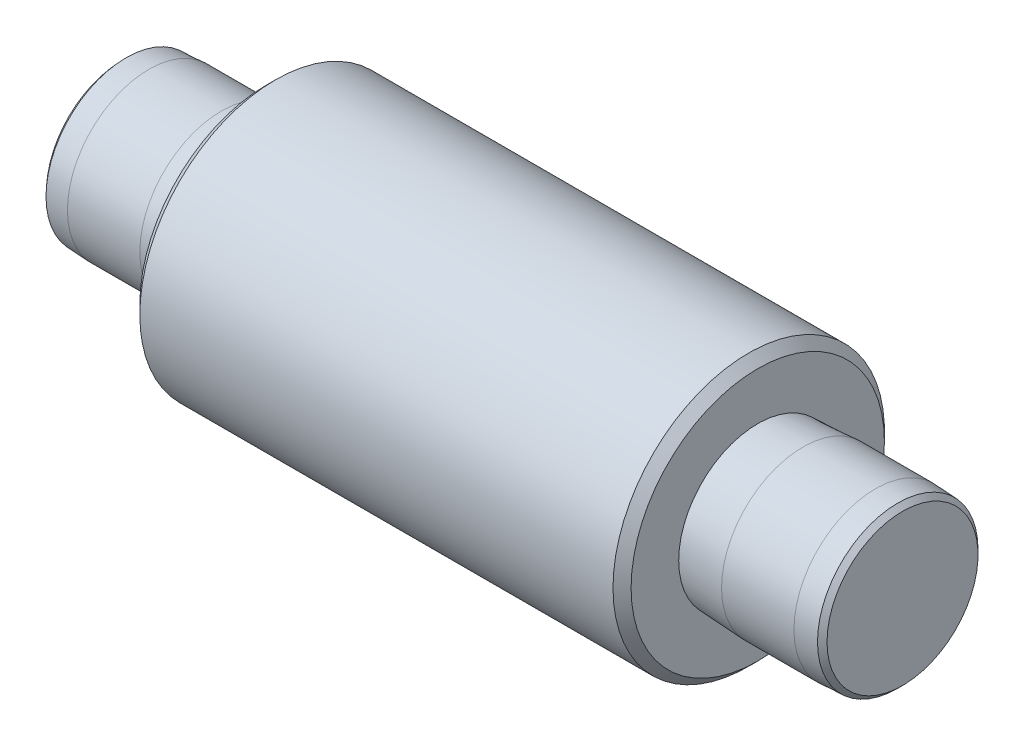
from build123d import *
from OCP.BRepFilletAPI import BRepFilletAPI_MakeChamfer

# Parameters (mm, degrees)
CHANFREIN1_SIZE  = 1
CHANFREIN2_SIZE  = 0.5
CHANFREIN2_SIZE2 = 0.528377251


with BuildPart() as part:
    # Esquisse1 → Base-R_volution (revolve)
    with BuildSketch(Plane.XY, mode=Mode.PRIVATE) as base_r_volution_sk:
        Polygon((-112.838114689, 8.842776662), (-109.838114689, 9), (-101.838114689, 9), (-96.838114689, 8.737961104), (-96.838114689, 15), (-42.538114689, 15), (-42.538114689, 8.737961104), (-37.538114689, 9), (-29.538114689, 9), (-26.538114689, 8.842776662), (-26.538114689, 0), (-112.838114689, 0), align=None)
    revolve(base_r_volution_sk.sketch.rotate(Axis((-130, 0, 0), (1, 0, 0)), 90), axis=Axis((-130, 0, 0), (1, 0, 0)))

    # Chanfrein1
    chanfrein1_edges = [part.edges().sort_by_distance(p)[0] for p in [
        (-96.838114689, 0, -15),
        (-42.538114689, 0, -15),
    ]]
    chamfer(chanfrein1_edges, length=CHANFREIN1_SIZE)

    # Chanfrein2: one chamfer whose edges measure the first distance from different faces: ONE call of the kernel's chamfer builder (chamfer() names one face for all edges)
    chanfrein2_edges_1 = [part.edges().sort_by_distance(p)[0] for p in [
        (-26.538114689, 0, -8.842776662),
    ]]
    chanfrein2_side_1 = [part.faces().sort_by_distance(p)[0] for p in [
        (-26.538114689, 0, 0),
    ]]
    chanfrein2_edges_2 = [part.edges().sort_by_distance(p)[0] for p in [
        (-112.838114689, 0, -8.842776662),
    ]]
    chanfrein2_side_2 = [part.faces().sort_by_distance(p)[0] for p in [
        (-111.338114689, 0, -8.921388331),
    ]]
    chanfrein2 = BRepFilletAPI_MakeChamfer(part.part.solid().wrapped)
    for e in chanfrein2_edges_1:
        chanfrein2.Add(CHANFREIN2_SIZE, CHANFREIN2_SIZE2, e.wrapped, chanfrein2_side_1[0].wrapped)  # the first distance lies on this face
    for e in chanfrein2_edges_2:
        chanfrein2.Add(CHANFREIN2_SIZE, CHANFREIN2_SIZE2, e.wrapped, chanfrein2_side_2[0].wrapped)  # the first distance lies on this face
    add(Compound.cast(chanfrein2.Shape()), mode=Mode.REPLACE)


solid = part.part
